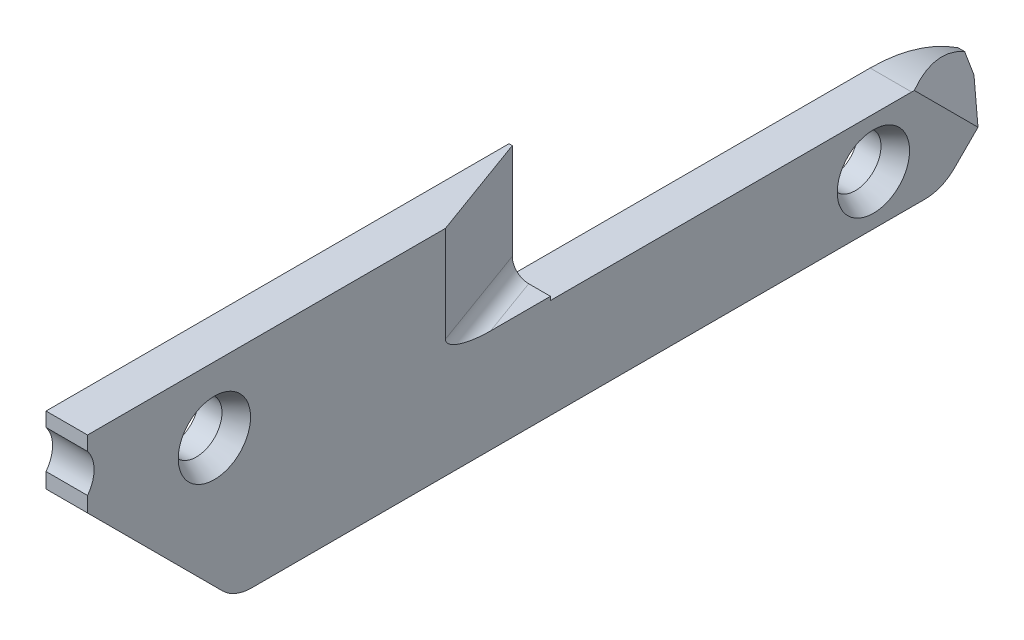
from build123d import *
from OCP.BRepFilletAPI import BRepFilletAPI_MakeChamfer

# Parameters (mm, degrees)
SKETCH_1_R          = 1.9812
EXTRUDE_1_DEPTH     = 3.2004
CUT_EXTRUDE_1_DEPTH = 59.460164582
CUT_EXTRUDE_2_DEPTH = 8.5852
FILLET_1_R          = 1.190625
CHAMFER_1_SIZE      = 1.397
CHAMFER_1_SIZE2     = 0.806558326


with BuildPart() as part:
    # Sketch 1 → Extrude 1 (new body)
    with BuildSketch(Plane(origin=(0, 0, 0), x_dir=(0, 0, -1), z_dir=(1, 0, 0))):
        with BuildLine():
            Line((53.7464, -3.7846), (25.908, -3.7846))
            Line((25.908, -3.7846), (25.908, 5.08))
            Line((25.908, 5.08), (-9.779, 5.08))
            Line((-9.779, 5.08), (-9.779, 3.984731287))
            ThreePointArc((-9.779, 3.984731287), (-9.271, 2.5146), (-9.779, 1.044468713))
            Line((-9.779, 1.044468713), (-9.779, -0.127))
            Line((-9.779, -0.127), (0.61946403, -10.52546403))
            ThreePointArc((0.61946403, -10.52546403), (1.649508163, -11.213717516), (2.864528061, -11.4554))
            Line((2.864528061, -11.4554), (54.7878, -11.4554))
            ThreePointArc((54.7878, -11.4554), (56.002819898, -11.213717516), (57.03286403, -10.52546403))
            Line((57.03286403, -10.52546403), (60.5282, -7.030128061))
            Line((60.5282, -7.030128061), (60.5282, -5.824430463))
            ThreePointArc((60.5282, -5.824430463), (57.287364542, -4.305597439), (53.7464, -3.7846))
        make_face()
        Circle(SKETCH_1_R, mode=Mode.SUBTRACT)
        with Locations((50.8, -7.62)):
            Circle(SKETCH_1_R, mode=Mode.SUBTRACT)
    extrude(amount=EXTRUDE_1_DEPTH)

    # Sketch 2 → Cut-Extrude 1 (cut, through all)
    with BuildSketch(Plane(origin=(0, -33.77916403, -33.77916403), x_dir=(1, 0, 0), z_dir=(0, -0.7071067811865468, -0.7071067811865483))):
        Polygon((3.2004, -35.472729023), (0.508, -38.681406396), (3.2004, -38.681406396), align=None)
    extrude(amount=-CUT_EXTRUDE_1_DEPTH, mode=Mode.SUBTRACT)

    # Sketch 3 → Cut-Extrude 2 (cut)
    with BuildSketch(Plane(origin=(0, 5.08, 0), x_dir=(1, 0, 0), z_dir=(0, 1, 0))):
        Polygon((3.2004, 17.812832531), (3.2004, 25.908), (0.254, 25.908), align=None)
    extrude(amount=-CUT_EXTRUDE_2_DEPTH, mode=Mode.SUBTRACT)

    # Fillet 1
    fillet_1_edges = [part.edges().sort_by_distance(p)[0] for p in [
        (1.7272, -3.5052, -21.860416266),
    ]]
    fillet(fillet_1_edges, radius=FILLET_1_R)

    # Chamfer 1: one chamfer whose edges measure the first distance from different faces: ONE call of the kernel's chamfer builder (chamfer() names one face for all edges)
    chamfer_1_edges_1 = [part.edges().sort_by_distance(p)[0] for p in [
        (3.2004, 0, 1.9812),
    ]]
    chamfer_1_side_1 = [part.faces().sort_by_distance(p)[0] for p in [
        (1.6002, 0, 1.9812),
    ]]
    chamfer_1_edges_2 = [part.edges().sort_by_distance(p)[0] for p in [
        (3.2004, -7.62, -48.8188),
    ]]
    chamfer_1_side_2 = [part.faces().sort_by_distance(p)[0] for p in [
        (1.6002, -7.62, -48.8188),
    ]]
    chamfer_1 = BRepFilletAPI_MakeChamfer(part.part.solid().wrapped)
    for e in chamfer_1_edges_1:
        chamfer_1.Add(CHAMFER_1_SIZE, CHAMFER_1_SIZE2, e.wrapped, chamfer_1_side_1[0].wrapped)  # the first distance lies on this face
    for e in chamfer_1_edges_2:
        chamfer_1.Add(CHAMFER_1_SIZE, CHAMFER_1_SIZE2, e.wrapped, chamfer_1_side_2[0].wrapped)  # the first distance lies on this face
    add(Compound.cast(chamfer_1.Shape()), mode=Mode.REPLACE)


solid = part.part
